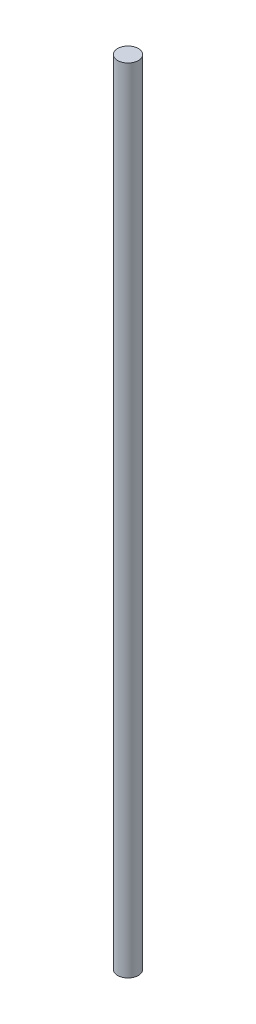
from build123d import *

# Parameters (mm, degrees)
SKETCH1_W = 12.5
SKETCH1_H = 950


with BuildPart() as part:
    # Sketch1 → Plain Central Support Pole (revolve)
    with BuildSketch(Plane.XY, mode=Mode.PRIVATE) as plain_central_support_pole_sk:
        with Locations((6.25, 475)):
            Rectangle(SKETCH1_W, SKETCH1_H)
    revolve(plain_central_support_pole_sk.sketch.rotate(Axis((0, -10, 0), (0, 1, 0)), 90), axis=Axis((0, -10, 0), (0, 1, 0)))


solid = part.part
